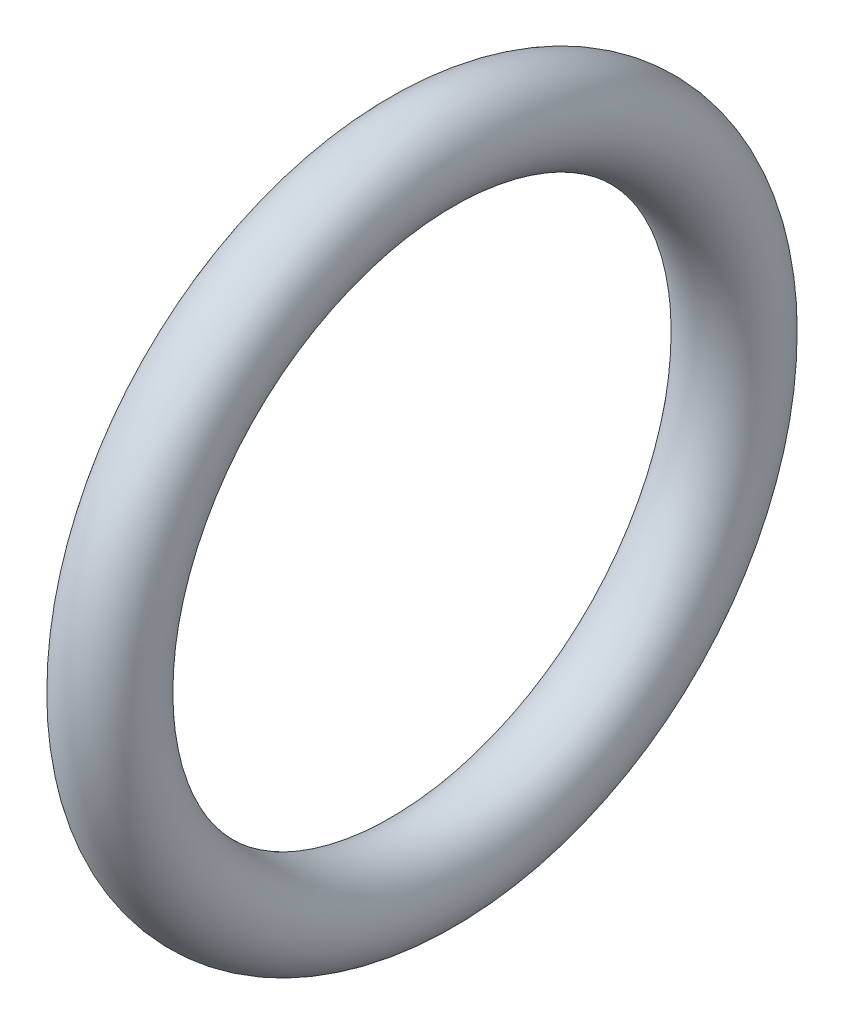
ISO-10303-21;
HEADER;
FILE_DESCRIPTION(('STEP AP214'),'2;1');
FILE_NAME('part.step','',(''),(''),'','','');
FILE_SCHEMA(('AUTOMOTIVE_DESIGN { 1 0 10303 214 1 1 1 1 }'));
ENDSEC;
DATA;
#1=APPLICATION_CONTEXT('core data for automotive mechanical design processes');
#2=APPLICATION_PROTOCOL_DEFINITION('international standard','automotive_design',2000,#1);
#3=PRODUCT_CONTEXT('',#1,'mechanical');
#4=PRODUCT('Part','Part','',(#3));
#5=PRODUCT_RELATED_PRODUCT_CATEGORY('part','',(#4));
#6=PRODUCT_DEFINITION_FORMATION('','',#4);
#7=PRODUCT_DEFINITION_CONTEXT('part definition',#1,'design');
#8=PRODUCT_DEFINITION('design','',#6,#7);
#9=PRODUCT_DEFINITION_SHAPE('','',#8);
#10=(LENGTH_UNIT() NAMED_UNIT(*) SI_UNIT(.MILLI.,.METRE.));
#11=(NAMED_UNIT(*) PLANE_ANGLE_UNIT() SI_UNIT($,.RADIAN.));
#12=(NAMED_UNIT(*) SI_UNIT($,.STERADIAN.) SOLID_ANGLE_UNIT());
#13=UNCERTAINTY_MEASURE_WITH_UNIT(LENGTH_MEASURE(1.E-05),#10,'distance_accuracy_value','');
#14=(GEOMETRIC_REPRESENTATION_CONTEXT(3) GLOBAL_UNCERTAINTY_ASSIGNED_CONTEXT((#13)) GLOBAL_UNIT_ASSIGNED_CONTEXT((#10,
#11,#12)) REPRESENTATION_CONTEXT('',''));
#15=CARTESIAN_POINT('',(0.,0.,0.));
#16=DIRECTION('',(0.,0.,1.));
#17=DIRECTION('',(1.,0.,0.));
#18=AXIS2_PLACEMENT_3D('',#15,#16,#17);
#19=CARTESIAN_POINT('',(0.,0.,0.));
#20=DIRECTION('',(-1.,0.,0.));
#21=DIRECTION('',(0.,0.,1.));
#22=AXIS2_PLACEMENT_3D('',#19,#20,#21);
#23=TOROIDAL_SURFACE('',#22,7.,1.);
#24=CARTESIAN_POINT('',(0.,0.,8.));
#25=VERTEX_POINT('',#24);
#26=VERTEX_LOOP('',#25);
#27=FACE_BOUND('',#26,.T.);
#28=ADVANCED_FACE('F27',(#27),#23,.T.);
#29=CLOSED_SHELL('',(#28));
#30=MANIFOLD_SOLID_BREP('B2',#29);
#31=ADVANCED_BREP_SHAPE_REPRESENTATION('',(#18,#30),#14);
#32=SHAPE_DEFINITION_REPRESENTATION(#9,#31);
ENDSEC;
END-ISO-10303-21;
